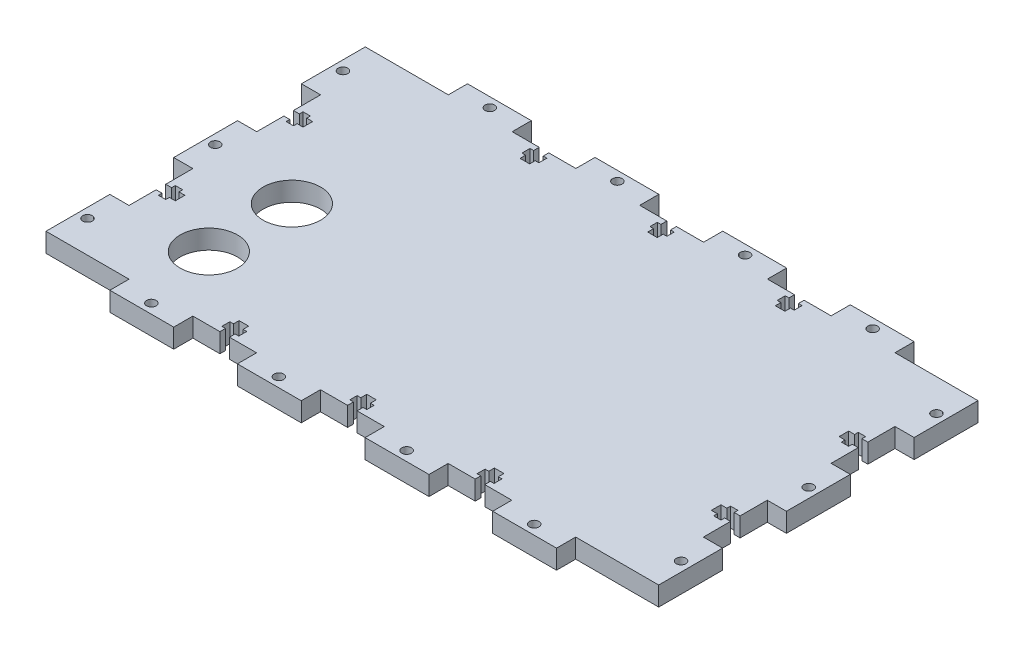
from build123d import *

# Parameters (mm, degrees)
SKETCH1_R           = 1.5
BOSS_EXTRUDE1_DEPTH = 6
SKETCH2_R           = 9
CUT_EXTRUDE1_DEPTH  = 220.301097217


with BuildPart() as part:
    # Sketch1 → Boss-Extrude1 (new body)
    with BuildSketch(Plane(origin=(0, 0, 0), x_dir=(1, 0, 0), z_dir=(0, 1, 0))):
        Polygon((0, 60), (6, 60), (6, 68.5), (7.85, 68.5), (7.85, 67.35), (10.15, 67.35), (10.15, 68.5), (12, 68.5), (12, 71.5), (10.15, 71.5), (10.15, 72.65), (7.85, 72.65), (7.85, 71.5), (6, 71.5), (6, 80), (0, 80), (0, 100), (26, 100), (26, 106), (46, 106), (46, 100), (54.471978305, 100), (54.471978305, 98.25), (53.321978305, 98.25), (53.321978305, 95.75), (54.471978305, 95.75), (54.471978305, 94), (57.471978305, 94), (57.471978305, 95.75), (58.621978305, 95.75), (58.621978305, 98.25), (57.471978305, 98.25), (57.471978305, 100), (65.943956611, 100), (65.943956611, 106), (85.943956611, 106), (85.943956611, 100), (94.443956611, 100), (94.443956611, 98.15), (93.293956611, 98.15), (93.293956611, 95.85), (94.443956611, 95.85), (94.443956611, 94), (97.443956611, 94), (97.443956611, 95.85), (98.593956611, 95.85), (98.593956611, 98.15), (97.443956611, 98.15), (97.443956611, 100), (105.943956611, 100), (105.943956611, 106), (125.943956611, 106), (125.943956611, 100), (134.415934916, 100), (134.415934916, 98.25), (133.265934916, 98.25), (133.265934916, 95.75), (134.415934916, 95.75), (134.415934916, 94), (137.415934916, 94), (137.415934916, 95.75), (138.565934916, 95.75), (138.565934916, 98.25), (137.415934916, 98.25), (137.415934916, 100), (145.887913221, 100), (145.887913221, 106), (165.887913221, 106), (165.887913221, 100), (191.887913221, 100), (191.887913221, 80), (185.887913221, 80), (185.887913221, 71.5), (184.037913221, 71.5), (184.037913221, 72.65), (181.737913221, 72.65), (181.737913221, 71.5), (179.887913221, 71.5), (179.887913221, 68.5), (181.737913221, 68.5), (181.737913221, 67.35), (184.037913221, 67.35), (184.037913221, 68.5), (185.887913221, 68.5), (185.887913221, 60), (191.887913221, 60), (191.887913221, 40), (185.887913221, 40), (185.887913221, 31.5), (184.037913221, 31.5), (184.037913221, 32.65), (181.737913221, 32.65), (181.737913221, 31.5), (179.887913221, 31.5), (179.887913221, 28.5), (181.737913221, 28.5), (181.737913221, 27.35), (184.037913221, 27.35), (184.037913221, 28.5), (185.887913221, 28.5), (185.887913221, 20), (191.887913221, 20), (191.887913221, 0), (165.887913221, 0), (165.887913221, -6), (145.887913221, -6), (145.887913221, 0), (137.415934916, 0), (137.415934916, 1.75), (138.565934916, 1.75), (138.565934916, 4.25), (137.415934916, 4.25), (137.415934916, 6), (134.415934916, 6), (134.415934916, 4.25), (133.265934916, 4.25), (133.265934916, 1.75), (134.415934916, 1.75), (134.415934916, 0), (125.943956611, 0), (125.943956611, -6), (105.943956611, -6), (105.943956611, 0), (97.443956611, 0), (97.443956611, 1.85), (98.593956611, 1.85), (98.593956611, 4.15), (97.443956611, 4.15), (97.443956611, 6), (94.443956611, 6), (94.443956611, 4.15), (93.293956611, 4.15), (93.293956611, 1.85), (94.443956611, 1.85), (94.443956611, 0), (85.943956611, 0), (85.943956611, -6), (65.943956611, -6), (65.943956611, 0), (57.471978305, 0), (57.471978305, 1.75), (58.621978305, 1.75), (58.621978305, 4.25), (57.471978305, 4.25), (57.471978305, 6), (54.471978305, 6), (54.471978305, 4.25), (53.321978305, 4.25), (53.321978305, 1.75), (54.471978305, 1.75), (54.471978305, 0), (46, 0), (46, -6), (26, -6), (26, 0), (0, 0), (0, 20), (6, 20), (6, 28.5), (7.85, 28.5), (7.85, 27.35), (10.15, 27.35), (10.15, 28.5), (12, 28.5), (12, 31.5), (10.15, 31.5), (10.15, 32.65), (7.85, 32.65), (7.85, 31.5), (6, 31.5), (6, 40), (0, 40), align=None)
        with Locations(Location((3, 90, 0), (0, 0, 270))):
            Circle(SKETCH1_R, mode=Mode.SUBTRACT)
        with Locations(Location((36, 103, 0), (0, 0, 270))):
            Circle(SKETCH1_R, mode=Mode.SUBTRACT)
        with Locations(Location((75.943956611, 103, 0), (0, 0, 270))):
            Circle(SKETCH1_R, mode=Mode.SUBTRACT)
        with Locations(Location((3, 50, 0), (0, 0, 270))):
            Circle(SKETCH1_R, mode=Mode.SUBTRACT)
        with Locations(Location((155.887913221, -3, 0), (0, 0, 270))):
            Circle(SKETCH1_R, mode=Mode.SUBTRACT)
        with Locations(Location((115.943956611, -3, 0), (0, 0, 270))):
            Circle(SKETCH1_R, mode=Mode.SUBTRACT)
        with Locations(Location((115.943956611, 103, 0), (0, 0, 90))):
            Circle(SKETCH1_R, mode=Mode.SUBTRACT)
        with Locations(Location((75.943956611, -3, 0), (0, 0, 90))):
            Circle(SKETCH1_R, mode=Mode.SUBTRACT)
        with Locations(Location((36, -3, 0), (0, 0, 90))):
            Circle(SKETCH1_R, mode=Mode.SUBTRACT)
        with Locations(Location((3, 10, 0), (0, 0, 90))):
            Circle(SKETCH1_R, mode=Mode.SUBTRACT)
        with Locations(Location((155.887913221, 103, 0), (0, 0, 90))):
            Circle(SKETCH1_R, mode=Mode.SUBTRACT)
        with Locations(Location((188.887913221, 90, 0), (0, 0, 90))):
            Circle(SKETCH1_R, mode=Mode.SUBTRACT)
        with Locations(Location((188.887913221, 50, 0), (0, 0, 90))):
            Circle(SKETCH1_R, mode=Mode.SUBTRACT)
        with Locations(Location((188.887913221, 10, 0), (0, 0, 270))):
            Circle(SKETCH1_R, mode=Mode.SUBTRACT)
    extrude(amount=BOSS_EXTRUDE1_DEPTH)

    # Sketch2 → Cut-Extrude1 (cut, through all)
    with BuildSketch(Plane(origin=(0, 6, 0), x_dir=(1, 0, 0), z_dir=(0, 1, 0))):
        with Locations(Location((31, 46, 0), (0, 0, 270))):
            Circle(SKETCH2_R)
        with Locations(Location((31, 20, 0), (0, 0, 270))):
            Circle(SKETCH2_R)
    extrude(amount=-CUT_EXTRUDE1_DEPTH, mode=Mode.SUBTRACT)


solid = part.part
